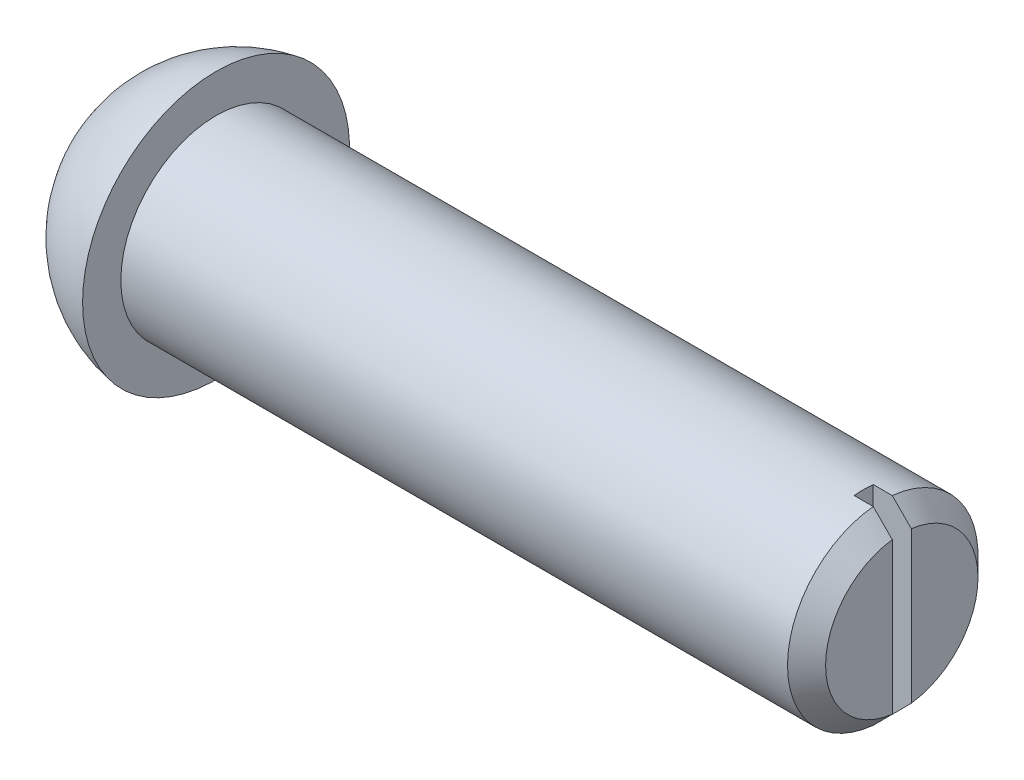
ISO-10303-21;
HEADER;
FILE_DESCRIPTION(('STEP AP214'),'2;1');
FILE_NAME('part.step','',(''),(''),'','','');
FILE_SCHEMA(('AUTOMOTIVE_DESIGN { 1 0 10303 214 1 1 1 1 }'));
ENDSEC;
DATA;
#1=APPLICATION_CONTEXT('core data for automotive mechanical design processes');
#2=APPLICATION_PROTOCOL_DEFINITION('international standard','automotive_design',2000,#1);
#3=PRODUCT_CONTEXT('',#1,'mechanical');
#4=PRODUCT('Part','Part','',(#3));
#5=PRODUCT_RELATED_PRODUCT_CATEGORY('part','',(#4));
#6=PRODUCT_DEFINITION_FORMATION('','',#4);
#7=PRODUCT_DEFINITION_CONTEXT('part definition',#1,'design');
#8=PRODUCT_DEFINITION('design','',#6,#7);
#9=PRODUCT_DEFINITION_SHAPE('','',#8);
#10=(LENGTH_UNIT() NAMED_UNIT(*) SI_UNIT(.MILLI.,.METRE.));
#11=(NAMED_UNIT(*) PLANE_ANGLE_UNIT() SI_UNIT($,.RADIAN.));
#12=(NAMED_UNIT(*) SI_UNIT($,.STERADIAN.) SOLID_ANGLE_UNIT());
#13=UNCERTAINTY_MEASURE_WITH_UNIT(LENGTH_MEASURE(1.E-05),#10,'distance_accuracy_value','');
#14=(GEOMETRIC_REPRESENTATION_CONTEXT(3) GLOBAL_UNCERTAINTY_ASSIGNED_CONTEXT((#13)) GLOBAL_UNIT_ASSIGNED_CONTEXT((#10,
#11,#12)) REPRESENTATION_CONTEXT('',''));
#15=CARTESIAN_POINT('',(0.,0.,0.));
#16=DIRECTION('',(0.,0.,1.));
#17=DIRECTION('',(1.,0.,0.));
#18=AXIS2_PLACEMENT_3D('',#15,#16,#17);
#19=CARTESIAN_POINT('',(-27.607860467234,2.5059352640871,0.));
#20=DIRECTION('',(1.,0.,0.));
#21=DIRECTION('',(0.,0.,-1.));
#22=AXIS2_PLACEMENT_3D('',#19,#20,#21);
#23=PLANE('',#22);
#24=DIRECTION('',(0.,-1.,0.));
#25=VECTOR('',#24,1.);
#26=CARTESIAN_POINT('',(-27.607860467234,5.37545091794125,0.250000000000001));
#27=LINE('',#26,#25);
#28=CARTESIAN_POINT('',(-27.607860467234,4.49024874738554,0.250000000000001));
#29=VERTEX_POINT('',#28);
#30=CARTESIAN_POINT('',(-27.607860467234,0.521621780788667,0.25));
#31=VERTEX_POINT('',#30);
#32=EDGE_CURVE('E86',#29,#31,#27,.T.);
#33=ORIENTED_EDGE('',*,*,#32,.F.);
#34=CARTESIAN_POINT('',(-27.607860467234,2.5059352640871,0.));
#35=DIRECTION('',(1.,0.,0.));
#36=DIRECTION('',(0.,0.,-1.));
#37=AXIS2_PLACEMENT_3D('',#34,#35,#36);
#38=CIRCLE('',#37,1.99999999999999);
#39=EDGE_CURVE('E95',#29,#31,#38,.T.);
#40=ORIENTED_EDGE('',*,*,#39,.T.);
#41=EDGE_LOOP('',(#33,#40));
#42=FACE_BOUND('',#41,.T.);
#43=ADVANCED_FACE('F31',(#42),#23,.T.);
#44=CARTESIAN_POINT('',(-28.107860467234,2.5059352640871,0.));
#45=DIRECTION('',(-1.,0.,0.));
#46=DIRECTION('',(0.,0.,1.));
#47=AXIS2_PLACEMENT_3D('',#44,#45,#46);
#48=CONICAL_SURFACE('',#47,2.5,0.785398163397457);
#49=CARTESIAN_POINT('',(-31.1230231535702,8.01542883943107,0.250000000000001));
#50=CARTESIAN_POINT('',(-30.9331737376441,7.82538253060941,0.250000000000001));
#51=CARTESIAN_POINT('',(-30.7433329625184,7.63532758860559,0.250000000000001));
#52=CARTESIAN_POINT('',(-30.3636789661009,7.2551884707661,0.250000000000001));
#53=CARTESIAN_POINT('',(-30.1738657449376,7.06510429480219,0.250000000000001));
#54=CARTESIAN_POINT('',(-29.7942591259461,6.68487670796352,0.250000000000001));
#55=CARTESIAN_POINT('',(-29.6044657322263,6.49473329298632,0.250000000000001));
#56=CARTESIAN_POINT('',(-29.2249403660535,6.11438685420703,0.250000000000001));
#57=CARTESIAN_POINT('',(-29.0352083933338,5.92418383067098,0.250000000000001));
#58=CARTESIAN_POINT('',(-28.6550163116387,5.54285510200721,0.250000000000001));
#59=CARTESIAN_POINT('',(-28.4645566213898,5.35172897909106,0.250000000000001));
#60=CARTESIAN_POINT('',(-28.0838124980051,4.96929747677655,0.250000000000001));
#61=CARTESIAN_POINT('',(-27.8935280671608,4.77799209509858,0.250000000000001));
#62=CARTESIAN_POINT('',(-27.5133061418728,4.39505981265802,0.250000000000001));
#63=CARTESIAN_POINT('',(-27.3233686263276,4.20343293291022,0.250000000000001));
#64=CARTESIAN_POINT('',(-27.0391570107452,3.91531126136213,0.25));
#65=CARTESIAN_POINT('',(-26.9445365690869,3.8191581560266,0.25));
#66=CARTESIAN_POINT('',(-26.7557298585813,3.62642688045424,0.25));
#67=CARTESIAN_POINT('',(-26.6615435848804,3.52984871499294,0.25));
#68=CARTESIAN_POINT('',(-26.5422764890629,3.40631185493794,0.25));
#69=CARTESIAN_POINT('',(-26.5167427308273,3.37979100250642,0.25));
#70=CARTESIAN_POINT('',(-26.4657764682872,3.32665207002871,0.25));
#71=CARTESIAN_POINT('',(-26.4403439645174,3.30003398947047,0.25));
#72=CARTESIAN_POINT('',(-26.3642496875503,3.22001188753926,0.25));
#73=CARTESIAN_POINT('',(-26.3137776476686,3.16642607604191,0.25));
#74=CARTESIAN_POINT('',(-26.2303520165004,3.07618365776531,0.25));
#75=CARTESIAN_POINT('',(-26.1971210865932,3.03978448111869,0.25));
#76=CARTESIAN_POINT('',(-26.1314299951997,2.96626457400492,0.25));
#77=CARTESIAN_POINT('',(-26.0989701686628,2.92914354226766,0.25));
#78=CARTESIAN_POINT('',(-26.0422320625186,2.86152855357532,0.25));
#79=CARTESIAN_POINT('',(-26.017667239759,2.83128011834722,0.25));
#80=CARTESIAN_POINT('',(-25.9822520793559,2.78480297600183,0.25));
#81=CARTESIAN_POINT('',(-25.9706846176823,2.76912488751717,0.25));
#82=CARTESIAN_POINT('',(-25.9482759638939,2.73726156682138,0.25));
#83=CARTESIAN_POINT('',(-25.9374344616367,2.72107655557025,0.25));
#84=CARTESIAN_POINT('',(-25.9164165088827,2.68729154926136,0.25));
#85=CARTESIAN_POINT('',(-25.9062888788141,2.66966063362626,0.25));
#86=CARTESIAN_POINT('',(-25.8880300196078,2.63337240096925,0.25));
#87=CARTESIAN_POINT('',(-25.8798959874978,2.61471657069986,0.25));
#88=CARTESIAN_POINT('',(-25.8685042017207,2.58091332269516,0.25));
#89=CARTESIAN_POINT('',(-25.8645421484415,2.56601299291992,0.25));
#90=CARTESIAN_POINT('',(-25.8591998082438,2.53577623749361,0.25));
#91=CARTESIAN_POINT('',(-25.8578113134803,2.52044135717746,0.25));
#92=CARTESIAN_POINT('',(-25.8579125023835,2.48973094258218,0.25));
#93=CARTESIAN_POINT('',(-25.8594117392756,2.47435544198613,0.25));
#94=CARTESIAN_POINT('',(-25.8649678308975,2.44406125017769,0.25));
#95=CARTESIAN_POINT('',(-25.8690316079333,2.4291439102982,0.25));
#96=CARTESIAN_POINT('',(-25.8795370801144,2.39852891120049,0.25));
#97=CARTESIAN_POINT('',(-25.8861753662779,2.38290160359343,0.25));
#98=CARTESIAN_POINT('',(-25.9009566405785,2.35236340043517,0.25));
#99=CARTESIAN_POINT('',(-25.9091025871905,2.33745398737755,0.25));
#100=CARTESIAN_POINT('',(-25.926445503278,2.30810286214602,0.25));
#101=CARTESIAN_POINT('',(-25.9356506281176,2.29366605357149,0.25));
#102=CARTESIAN_POINT('',(-25.9547233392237,2.26526218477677,0.25));
#103=CARTESIAN_POINT('',(-25.9645902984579,2.25129469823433,0.25));
#104=CARTESIAN_POINT('',(-25.9968058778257,2.20725485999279,0.25));
#105=CARTESIAN_POINT('',(-26.0200200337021,2.17782050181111,0.25));
#106=CARTESIAN_POINT('',(-26.0675368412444,2.11983864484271,0.25));
#107=CARTESIAN_POINT('',(-26.0918401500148,2.0912916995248,0.25));
#108=CARTESIAN_POINT('',(-26.1411224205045,2.03470042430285,0.25));
#109=CARTESIAN_POINT('',(-26.166102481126,2.00665705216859,0.25));
#110=CARTESIAN_POINT('',(-26.2164509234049,1.95093741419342,0.25));
#111=CARTESIAN_POINT('',(-26.2418191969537,1.92326105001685,0.25));
#112=CARTESIAN_POINT('',(-26.3181283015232,1.84078731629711,0.25));
#113=CARTESIAN_POINT('',(-26.3694520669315,1.78634483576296,0.25));
#114=CARTESIAN_POINT('',(-26.4725597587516,1.67800442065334,0.25));
#115=CARTESIAN_POINT('',(-26.524343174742,1.62410599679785,0.25));
#116=CARTESIAN_POINT('',(-26.6797154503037,1.46326500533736,0.25));
#117=CARTESIAN_POINT('',(-26.7837377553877,1.35674146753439,0.25));
#118=CARTESIAN_POINT('',(-26.9922543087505,1.14415549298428,0.25));
#119=CARTESIAN_POINT('',(-27.0967485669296,1.03809306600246,0.25));
#120=CARTESIAN_POINT('',(-27.3060365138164,0.82617871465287,0.25));
#121=CARTESIAN_POINT('',(-27.4108303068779,0.720326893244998,0.25));
#122=CARTESIAN_POINT('',(-27.6205648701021,0.50877085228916,0.25));
#123=CARTESIAN_POINT('',(-27.7255056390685,0.403066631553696,0.25));
#124=CARTESIAN_POINT('',(-28.0405370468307,0.086019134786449,0.25));
#125=CARTESIAN_POINT('',(-28.2507656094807,-0.125187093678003,0.25));
#126=CARTESIAN_POINT('',(-28.6713669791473,-0.547406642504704,0.25));
#127=CARTESIAN_POINT('',(-28.8817397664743,-0.758419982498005,0.25));
#128=CARTESIAN_POINT('',(-29.2613511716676,-1.13901221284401,0.25));
#129=CARTESIAN_POINT('',(-29.4305726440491,-1.30860820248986,0.25));
#130=CARTESIAN_POINT('',(-29.7690634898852,-1.64776460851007,0.25));
#131=CARTESIAN_POINT('',(-29.9383328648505,-1.8173250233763,0.25));
#132=CARTESIAN_POINT('',(-30.2768301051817,-2.15634599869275,0.25));
#133=CARTESIAN_POINT('',(-30.4460579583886,-2.32580657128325,0.25));
#134=CARTESIAN_POINT('',(-30.784529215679,-2.66469990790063,0.25));
#135=CARTESIAN_POINT('',(-30.9537726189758,-2.83413267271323,0.25));
#136=CARTESIAN_POINT('',(-31.1230231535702,-3.00355831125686,0.25));
#137=B_SPLINE_CURVE_WITH_KNOTS('',3,(#49,#50,#51,#52,#53,#54,#55,#56,#57,#58,#59,#60,#61,#62,
#63,#64,#65,#66,#67,#68,#69,#70,#71,#72,#73,#74,#75,#76,#77,#78,#79,#80,#81,#82,#83,#84,#85,#86,
#87,#88,#89,#90,#91,#92,#93,#94,#95,#96,#97,#98,#99,#100,#101,#102,#103,#104,#105,#106,#107,
#108,#109,#110,#111,#112,#113,#114,#115,#116,#117,#118,#119,#120,#121,#122,#123,#124,#125,#126,
#127,#128,#129,#130,#131,#132,#133,#134,#135,#136),.UNSPECIFIED.,.F.,.F.,(4,2,2,2,2,2,2,2,2,2,2,
2,2,2,2,2,2,2,2,2,2,2,2,2,2,2,2,2,2,2,2,2,2,2,2,2,2,2,2,2,2,2,2,4),(0.,0.80588063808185,
1.61176491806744,2.41773292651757,3.22369738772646,4.03316422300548,4.84264149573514,
5.65206777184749,6.05677243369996,6.46147256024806,6.57191662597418,6.68236127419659,
6.90319237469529,7.05104667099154,7.19896405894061,7.31581599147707,7.37425366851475,
7.43266621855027,7.49359698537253,7.55444158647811,7.60052260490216,7.64645640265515,
7.69254242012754,7.73875336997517,7.78956880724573,7.84048503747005,7.89182348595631,
7.94311396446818,8.05551014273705,8.16797506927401,8.28063508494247,8.39326427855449,
8.61771725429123,8.84194620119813,9.28860744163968,9.73527809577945,10.1821301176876,
10.6289785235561,11.5229788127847,12.4168748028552,13.1356156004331,13.8543823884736,
14.5728492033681,15.2912899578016),.UNSPECIFIED.);
#138=CARTESIAN_POINT('',(-28.107860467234,4.99340385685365,0.250000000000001));
#139=VERTEX_POINT('',#138);
#140=EDGE_CURVE('E83',#139,#29,#137,.T.);
#141=ORIENTED_EDGE('',*,*,#140,.F.);
#142=CARTESIAN_POINT('',(-28.107860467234,2.5059352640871,0.));
#143=DIRECTION('',(1.,0.,0.));
#144=DIRECTION('',(0.,0.,-1.));
#145=AXIS2_PLACEMENT_3D('',#142,#143,#144);
#146=CIRCLE('',#145,2.5);
#147=CARTESIAN_POINT('',(-28.107860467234,0.018466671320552,0.25));
#148=VERTEX_POINT('',#147);
#149=EDGE_CURVE('E104',#148,#139,#146,.F.);
#150=ORIENTED_EDGE('',*,*,#149,.F.);
#151=EDGE_CURVE('E92',#31,#148,#137,.T.);
#152=ORIENTED_EDGE('',*,*,#151,.F.);
#153=ORIENTED_EDGE('',*,*,#39,.F.);
#154=EDGE_LOOP('',(#141,#150,#152,#153));
#155=FACE_BOUND('',#154,.T.);
#156=ADVANCED_FACE('F97',(#155),#48,.T.);
#157=DIRECTION('',(0.,1.,0.));
#158=VECTOR('',#157,1.);
#159=CARTESIAN_POINT('',(-27.607860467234,5.37545091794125,-0.249999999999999));
#160=LINE('',#159,#158);
#161=CARTESIAN_POINT('',(-27.607860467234,0.521621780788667,-0.25));
#162=VERTEX_POINT('',#161);
#163=CARTESIAN_POINT('',(-27.607860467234,4.49024874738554,-0.25));
#164=VERTEX_POINT('',#163);
#165=EDGE_CURVE('E47',#162,#164,#160,.T.);
#166=ORIENTED_EDGE('',*,*,#165,.F.);
#167=EDGE_CURVE('E99',#162,#164,#38,.T.);
#168=ORIENTED_EDGE('',*,*,#167,.T.);
#169=EDGE_LOOP('',(#166,#168));
#170=FACE_BOUND('',#169,.T.);
#171=ADVANCED_FACE('F134',(#170),#23,.T.);
#172=CARTESIAN_POINT('',(-45.0619225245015,2.5059352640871,0.));
#173=DIRECTION('',(-1.,0.,0.));
#174=DIRECTION('',(0.,1.,0.));
#175=AXIS2_PLACEMENT_3D('',#172,#173,#174);
#176=SPHERICAL_SURFACE('',#175,3.54593794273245);
#177=CARTESIAN_POINT('',(-45.607860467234,2.5059352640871,0.));
#178=DIRECTION('',(-1.,0.,0.));
#179=DIRECTION('',(0.,0.,1.));
#180=AXIS2_PLACEMENT_3D('',#177,#178,#179);
#181=CIRCLE('',#180,3.50365918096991);
#182=CARTESIAN_POINT('',(-45.607860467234,2.5059352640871,3.50365918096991));
#183=VERTEX_POINT('',#182);
#184=EDGE_CURVE('E211',#183,#183,#181,.T.);
#185=ORIENTED_EDGE('',*,*,#184,.T.);
#186=EDGE_LOOP('',(#185));
#187=FACE_BOUND('',#186,.T.);
#188=ADVANCED_FACE('F131',(#187),#176,.T.);
#189=CARTESIAN_POINT('',(-45.6078604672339,0.0059352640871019,0.));
#190=DIRECTION('',(1.,0.,0.));
#191=DIRECTION('',(0.,0.,-1.));
#192=AXIS2_PLACEMENT_3D('',#189,#190,#191);
#193=PLANE('',#192);
#194=CARTESIAN_POINT('',(-45.6078604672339,2.5059352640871,0.));
#195=DIRECTION('',(-1.,0.,0.));
#196=DIRECTION('',(0.,0.,1.));
#197=AXIS2_PLACEMENT_3D('',#194,#195,#196);
#198=CIRCLE('',#197,2.5);
#199=CARTESIAN_POINT('',(-45.6078604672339,2.5059352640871,2.5));
#200=VERTEX_POINT('',#199);
#201=EDGE_CURVE('E207',#200,#200,#198,.T.);
#202=ORIENTED_EDGE('',*,*,#201,.T.);
#203=EDGE_LOOP('',(#202));
#204=FACE_BOUND('',#203,.T.);
#205=ORIENTED_EDGE('',*,*,#184,.F.);
#206=EDGE_LOOP('',(#205));
#207=FACE_BOUND('',#206,.T.);
#208=ADVANCED_FACE('F127',(#204,#207),#193,.T.);
#209=CARTESIAN_POINT('',(-48.607860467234,2.5059352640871,0.));
#210=DIRECTION('',(-1.,0.,0.));
#211=DIRECTION('',(0.,0.,1.));
#212=AXIS2_PLACEMENT_3D('',#209,#210,#211);
#213=CYLINDRICAL_SURFACE('',#212,2.5);
#214=DIRECTION('',(-1.,0.,0.));
#215=VECTOR('',#214,1.);
#216=CARTESIAN_POINT('',(-48.607860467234,0.0184666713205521,0.25));
#217=LINE('',#216,#215);
#218=CARTESIAN_POINT('',(-28.607860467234,0.0184666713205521,0.25));
#219=VERTEX_POINT('',#218);
#220=EDGE_CURVE('E208',#148,#219,#217,.T.);
#221=ORIENTED_EDGE('',*,*,#220,.F.);
#222=ORIENTED_EDGE('',*,*,#149,.T.);
#223=DIRECTION('',(-1.,0.,0.));
#224=VECTOR('',#223,1.);
#225=CARTESIAN_POINT('',(-48.607860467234,4.99340385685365,0.250000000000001));
#226=LINE('',#225,#224);
#227=CARTESIAN_POINT('',(-28.607860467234,4.99340385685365,0.250000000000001));
#228=VERTEX_POINT('',#227);
#229=EDGE_CURVE('E55',#228,#139,#226,.F.);
#230=ORIENTED_EDGE('',*,*,#229,.F.);
#231=CARTESIAN_POINT('',(-28.607860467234,2.5059352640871,0.));
#232=DIRECTION('',(1.,0.,0.));
#233=DIRECTION('',(0.,0.,-1.));
#234=AXIS2_PLACEMENT_3D('',#231,#232,#233);
#235=CIRCLE('',#234,2.5);
#236=CARTESIAN_POINT('',(-28.607860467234,4.99340385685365,-0.249999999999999));
#237=VERTEX_POINT('',#236);
#238=EDGE_CURVE('E36',#228,#237,#235,.F.);
#239=ORIENTED_EDGE('',*,*,#238,.T.);
#240=DIRECTION('',(-1.,0.,0.));
#241=VECTOR('',#240,1.);
#242=CARTESIAN_POINT('',(-48.607860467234,4.99340385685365,-0.249999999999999));
#243=LINE('',#242,#241);
#244=CARTESIAN_POINT('',(-28.107860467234,4.99340385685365,-0.249999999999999));
#245=VERTEX_POINT('',#244);
#246=EDGE_CURVE('E199',#245,#237,#243,.T.);
#247=ORIENTED_EDGE('',*,*,#246,.F.);
#248=CARTESIAN_POINT('',(-28.107860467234,0.0184666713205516,-0.25));
#249=VERTEX_POINT('',#248);
#250=EDGE_CURVE('E106',#245,#249,#146,.F.);
#251=ORIENTED_EDGE('',*,*,#250,.T.);
#252=DIRECTION('',(-1.,0.,0.));
#253=VECTOR('',#252,1.);
#254=CARTESIAN_POINT('',(-48.607860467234,0.0184666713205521,-0.25));
#255=LINE('',#254,#253);
#256=CARTESIAN_POINT('',(-28.607860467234,0.0184666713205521,-0.25));
#257=VERTEX_POINT('',#256);
#258=EDGE_CURVE('E213',#257,#249,#255,.F.);
#259=ORIENTED_EDGE('',*,*,#258,.F.);
#260=EDGE_CURVE('E11',#257,#219,#235,.F.);
#261=ORIENTED_EDGE('',*,*,#260,.T.);
#262=EDGE_LOOP('',(#221,#222,#230,#239,#247,#251,#259,#261));
#263=FACE_BOUND('',#262,.T.);
#264=ORIENTED_EDGE('',*,*,#201,.F.);
#265=EDGE_LOOP('',(#264));
#266=FACE_BOUND('',#265,.T.);
#267=ADVANCED_FACE('F124',(#263,#266),#213,.T.);
#268=CARTESIAN_POINT('',(-31.1230231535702,-3.00355831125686,-0.25));
#269=CARTESIAN_POINT('',(-30.9331737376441,-2.81351200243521,-0.25));
#270=CARTESIAN_POINT('',(-30.7433329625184,-2.62345706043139,-0.25));
#271=CARTESIAN_POINT('',(-30.3636789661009,-2.2433179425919,-0.25));
#272=CARTESIAN_POINT('',(-30.1738657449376,-2.05323376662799,-0.25));
#273=CARTESIAN_POINT('',(-29.7942591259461,-1.67300617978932,-0.25));
#274=CARTESIAN_POINT('',(-29.6044657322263,-1.48286276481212,-0.25));
#275=CARTESIAN_POINT('',(-29.2249403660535,-1.10251632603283,-0.25));
#276=CARTESIAN_POINT('',(-29.0352083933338,-0.912313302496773,-0.25));
#277=CARTESIAN_POINT('',(-28.6550163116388,-0.530984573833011,-0.25));
#278=CARTESIAN_POINT('',(-28.4645566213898,-0.339858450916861,-0.25));
#279=CARTESIAN_POINT('',(-28.0838124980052,0.0425730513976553,-0.25));
#280=CARTESIAN_POINT('',(-27.8935280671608,0.233878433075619,-0.25));
#281=CARTESIAN_POINT('',(-27.5133061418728,0.616810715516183,-0.25));
#282=CARTESIAN_POINT('',(-27.3233686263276,0.808437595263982,-0.25));
#283=CARTESIAN_POINT('',(-27.0391570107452,1.09655926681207,-0.25));
#284=CARTESIAN_POINT('',(-26.9445365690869,1.1927123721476,-0.25));
#285=CARTESIAN_POINT('',(-26.7557298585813,1.38544364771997,-0.25));
#286=CARTESIAN_POINT('',(-26.6615435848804,1.48202181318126,-0.25));
#287=CARTESIAN_POINT('',(-26.5422764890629,1.60555867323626,-0.25));
#288=CARTESIAN_POINT('',(-26.5167427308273,1.63207952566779,-0.25));
#289=CARTESIAN_POINT('',(-26.4657764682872,1.6852184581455,-0.25));
#290=CARTESIAN_POINT('',(-26.4403439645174,1.71183653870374,-0.25));
#291=CARTESIAN_POINT('',(-26.3642496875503,1.79185864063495,-0.25));
#292=CARTESIAN_POINT('',(-26.3137776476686,1.84544445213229,-0.25));
#293=CARTESIAN_POINT('',(-26.2303520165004,1.9356868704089,-0.25));
#294=CARTESIAN_POINT('',(-26.1971210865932,1.97208604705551,-0.25));
#295=CARTESIAN_POINT('',(-26.1314299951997,2.04560595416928,-0.25));
#296=CARTESIAN_POINT('',(-26.0989701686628,2.08272698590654,-0.25));
#297=CARTESIAN_POINT('',(-26.0422320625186,2.15034197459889,-0.25));
#298=CARTESIAN_POINT('',(-26.017667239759,2.18059040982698,-0.25));
#299=CARTESIAN_POINT('',(-25.9822520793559,2.22706755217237,-0.25));
#300=CARTESIAN_POINT('',(-25.9706846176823,2.24274564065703,-0.25));
#301=CARTESIAN_POINT('',(-25.9482759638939,2.27460896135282,-0.25));
#302=CARTESIAN_POINT('',(-25.9374344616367,2.29079397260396,-0.25));
#303=CARTESIAN_POINT('',(-25.9164165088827,2.32457897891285,-0.25));
#304=CARTESIAN_POINT('',(-25.9062888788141,2.34220989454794,-0.25));
#305=CARTESIAN_POINT('',(-25.8880300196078,2.37849812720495,-0.25));
#306=CARTESIAN_POINT('',(-25.8798959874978,2.39715395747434,-0.25));
#307=CARTESIAN_POINT('',(-25.8685042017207,2.43095720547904,-0.25));
#308=CARTESIAN_POINT('',(-25.8645421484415,2.44585753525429,-0.25));
#309=CARTESIAN_POINT('',(-25.8591998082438,2.47609429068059,-0.25));
#310=CARTESIAN_POINT('',(-25.8578113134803,2.49142917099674,-0.25));
#311=CARTESIAN_POINT('',(-25.8579125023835,2.52213958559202,-0.25));
#312=CARTESIAN_POINT('',(-25.8594117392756,2.53751508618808,-0.25));
#313=CARTESIAN_POINT('',(-25.8649678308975,2.56780927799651,-0.25));
#314=CARTESIAN_POINT('',(-25.8690316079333,2.58272661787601,-0.25));
#315=CARTESIAN_POINT('',(-25.8795370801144,2.61334161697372,-0.25));
#316=CARTESIAN_POINT('',(-25.8861753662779,2.62896892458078,-0.25));
#317=CARTESIAN_POINT('',(-25.9009566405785,2.65950712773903,-0.25));
#318=CARTESIAN_POINT('',(-25.9091025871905,2.67441654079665,-0.25));
#319=CARTESIAN_POINT('',(-25.926445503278,2.70376766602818,-0.25));
#320=CARTESIAN_POINT('',(-25.9356506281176,2.71820447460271,-0.25));
#321=CARTESIAN_POINT('',(-25.9547233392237,2.74660834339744,-0.25));
#322=CARTESIAN_POINT('',(-25.9645902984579,2.76057582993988,-0.25));
#323=CARTESIAN_POINT('',(-25.9968058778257,2.80461566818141,-0.25));
#324=CARTESIAN_POINT('',(-26.0200200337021,2.83405002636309,-0.25));
#325=CARTESIAN_POINT('',(-26.0675368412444,2.89203188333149,-0.25));
#326=CARTESIAN_POINT('',(-26.0918401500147,2.92057882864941,-0.25));
#327=CARTESIAN_POINT('',(-26.1411224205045,2.97717010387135,-0.25));
#328=CARTESIAN_POINT('',(-26.166102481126,3.00521347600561,-0.25));
#329=CARTESIAN_POINT('',(-26.2164509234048,3.06093311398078,-0.25));
#330=CARTESIAN_POINT('',(-26.2418191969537,3.08860947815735,-0.25));
#331=CARTESIAN_POINT('',(-26.3181283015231,3.17108321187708,-0.25));
#332=CARTESIAN_POINT('',(-26.3694520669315,3.22552569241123,-0.25));
#333=CARTESIAN_POINT('',(-26.4725597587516,3.33386610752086,-0.25));
#334=CARTESIAN_POINT('',(-26.524343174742,3.38776453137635,-0.25));
#335=CARTESIAN_POINT('',(-26.6797154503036,3.54860552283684,-0.25));
#336=CARTESIAN_POINT('',(-26.7837377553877,3.6551290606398,-0.25));
#337=CARTESIAN_POINT('',(-26.9922543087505,3.86771503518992,-0.25));
#338=CARTESIAN_POINT('',(-27.0967485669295,3.97377746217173,-0.25));
#339=CARTESIAN_POINT('',(-27.3060365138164,4.18569181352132,-0.25));
#340=CARTESIAN_POINT('',(-27.4108303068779,4.29154363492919,-0.249999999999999));
#341=CARTESIAN_POINT('',(-27.6205648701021,4.50309967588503,-0.249999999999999));
#342=CARTESIAN_POINT('',(-27.7255056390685,4.60880389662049,-0.249999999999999));
#343=CARTESIAN_POINT('',(-28.0405370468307,4.92585139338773,-0.249999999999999));
#344=CARTESIAN_POINT('',(-28.2507656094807,5.13705762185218,-0.249999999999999));
#345=CARTESIAN_POINT('',(-28.6713669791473,5.55927717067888,-0.249999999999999));
#346=CARTESIAN_POINT('',(-28.8817397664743,5.77029051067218,-0.249999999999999));
#347=CARTESIAN_POINT('',(-29.2613511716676,6.1508827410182,-0.249999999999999));
#348=CARTESIAN_POINT('',(-29.4305726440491,6.32047873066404,-0.249999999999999));
#349=CARTESIAN_POINT('',(-29.7690634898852,6.65963513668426,-0.249999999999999));
#350=CARTESIAN_POINT('',(-29.9383328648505,6.82919555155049,-0.249999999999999));
#351=CARTESIAN_POINT('',(-30.2768301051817,7.16821652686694,-0.249999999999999));
#352=CARTESIAN_POINT('',(-30.4460579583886,7.33767709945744,-0.249999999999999));
#353=CARTESIAN_POINT('',(-30.784529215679,7.67657043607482,-0.249999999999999));
#354=CARTESIAN_POINT('',(-30.9537726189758,7.84600320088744,-0.249999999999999));
#355=CARTESIAN_POINT('',(-31.1230231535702,8.01542883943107,-0.249999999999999));
#356=B_SPLINE_CURVE_WITH_KNOTS('',3,(#268,#269,#270,#271,#272,#273,#274,#275,#276,#277,#278,
#279,#280,#281,#282,#283,#284,#285,#286,#287,#288,#289,#290,#291,#292,#293,#294,#295,#296,#297,
#298,#299,#300,#301,#302,#303,#304,#305,#306,#307,#308,#309,#310,#311,#312,#313,#314,#315,#316,
#317,#318,#319,#320,#321,#322,#323,#324,#325,#326,#327,#328,#329,#330,#331,#332,#333,#334,#335,
#336,#337,#338,#339,#340,#341,#342,#343,#344,#345,#346,#347,#348,#349,#350,#351,#352,#353,#354,
#355),.UNSPECIFIED.,.F.,.F.,(4,2,2,2,2,2,2,2,2,2,2,2,2,2,2,2,2,2,2,2,2,2,2,2,2,2,2,2,2,2,2,2,2,
2,2,2,2,2,2,2,2,2,2,4),(0.,0.805880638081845,1.61176491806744,2.41773292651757,3.22369738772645,
4.03316422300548,4.84264149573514,5.65206777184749,6.05677243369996,6.46147256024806,
6.57191662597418,6.68236127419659,6.90319237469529,7.05104667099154,7.19896405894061,
7.31581599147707,7.37425366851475,7.43266621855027,7.49359698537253,7.55444158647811,
7.60052260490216,7.64645640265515,7.69254242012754,7.73875336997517,7.78956880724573,
7.84048503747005,7.89182348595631,7.94311396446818,8.05551014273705,8.167975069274,
8.28063508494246,8.39326427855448,8.61771725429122,8.84194620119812,9.28860744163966,
9.73527809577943,10.1821301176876,10.6289785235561,11.5229788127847,12.4168748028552,
13.135615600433,13.8543823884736,14.5728492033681,15.2912899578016),.UNSPECIFIED.);
#357=EDGE_CURVE('E101',#249,#162,#356,.T.);
#358=ORIENTED_EDGE('',*,*,#357,.F.);
#359=ORIENTED_EDGE('',*,*,#250,.F.);
#360=EDGE_CURVE('E98',#164,#245,#356,.T.);
#361=ORIENTED_EDGE('',*,*,#360,.F.);
#362=ORIENTED_EDGE('',*,*,#167,.F.);
#363=EDGE_LOOP('',(#358,#359,#361,#362));
#364=FACE_BOUND('',#363,.T.);
#365=ADVANCED_FACE('F33',(#364),#48,.T.);
#366=CARTESIAN_POINT('',(-28.607860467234,5.37545091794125,0.250000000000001));
#367=DIRECTION('',(0.,0.,1.));
#368=DIRECTION('',(0.,-1.,0.));
#369=AXIS2_PLACEMENT_3D('',#366,#367,#368);
#370=PLANE('',#369);
#371=ORIENTED_EDGE('',*,*,#229,.T.);
#372=ORIENTED_EDGE('',*,*,#140,.T.);
#373=ORIENTED_EDGE('',*,*,#32,.T.);
#374=ORIENTED_EDGE('',*,*,#151,.T.);
#375=ORIENTED_EDGE('',*,*,#220,.T.);
#376=DIRECTION('',(0.,-1.,0.));
#377=VECTOR('',#376,1.);
#378=CARTESIAN_POINT('',(-28.607860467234,5.37545091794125,0.250000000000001));
#379=LINE('',#378,#377);
#380=EDGE_CURVE('E200',#228,#219,#379,.T.);
#381=ORIENTED_EDGE('',*,*,#380,.F.);
#382=EDGE_LOOP('',(#371,#372,#373,#374,#375,#381));
#383=FACE_BOUND('',#382,.T.);
#384=ADVANCED_FACE('F85',(#383),#370,.F.);
#385=CARTESIAN_POINT('',(-28.607860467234,5.37545091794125,-0.249999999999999));
#386=DIRECTION('',(0.,0.,-1.));
#387=DIRECTION('',(0.,1.,0.));
#388=AXIS2_PLACEMENT_3D('',#385,#386,#387);
#389=PLANE('',#388);
#390=ORIENTED_EDGE('',*,*,#258,.T.);
#391=ORIENTED_EDGE('',*,*,#357,.T.);
#392=ORIENTED_EDGE('',*,*,#165,.T.);
#393=ORIENTED_EDGE('',*,*,#360,.T.);
#394=ORIENTED_EDGE('',*,*,#246,.T.);
#395=DIRECTION('',(0.,1.,0.));
#396=VECTOR('',#395,1.);
#397=CARTESIAN_POINT('',(-28.607860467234,5.37545091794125,-0.249999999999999));
#398=LINE('',#397,#396);
#399=EDGE_CURVE('E195',#257,#237,#398,.T.);
#400=ORIENTED_EDGE('',*,*,#399,.F.);
#401=EDGE_LOOP('',(#390,#391,#392,#393,#394,#400));
#402=FACE_BOUND('',#401,.T.);
#403=ADVANCED_FACE('F116',(#402),#389,.F.);
#404=CARTESIAN_POINT('',(-28.607860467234,-0.195166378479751,0.25));
#405=DIRECTION('',(1.,0.,0.));
#406=DIRECTION('',(0.,0.,-1.));
#407=AXIS2_PLACEMENT_3D('',#404,#405,#406);
#408=PLANE('',#407);
#409=ORIENTED_EDGE('',*,*,#399,.T.);
#410=ORIENTED_EDGE('',*,*,#238,.F.);
#411=ORIENTED_EDGE('',*,*,#380,.T.);
#412=ORIENTED_EDGE('',*,*,#260,.F.);
#413=EDGE_LOOP('',(#409,#410,#411,#412));
#414=FACE_BOUND('',#413,.T.);
#415=ADVANCED_FACE('F120',(#414),#408,.T.);
#416=CLOSED_SHELL('',(#43,#156,#171,#188,#208,#267,#365,#384,#403,#415));
#417=MANIFOLD_SOLID_BREP('B2',#416);
#418=ADVANCED_BREP_SHAPE_REPRESENTATION('',(#18,#417),#14);
#419=SHAPE_DEFINITION_REPRESENTATION(#9,#418);
ENDSEC;
END-ISO-10303-21;
